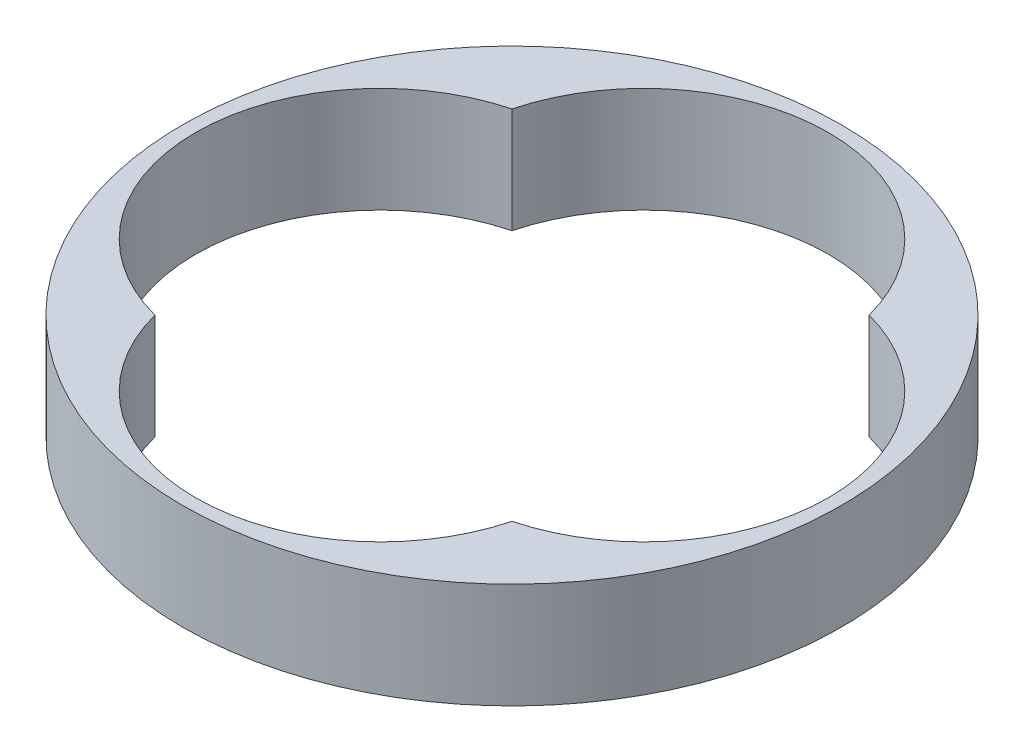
ISO-10303-21;
HEADER;
FILE_DESCRIPTION(('STEP AP214'),'2;1');
FILE_NAME('part.step','',(''),(''),'','','');
FILE_SCHEMA(('AUTOMOTIVE_DESIGN { 1 0 10303 214 1 1 1 1 }'));
ENDSEC;
DATA;
#1=APPLICATION_CONTEXT('core data for automotive mechanical design processes');
#2=APPLICATION_PROTOCOL_DEFINITION('international standard','automotive_design',2000,#1);
#3=PRODUCT_CONTEXT('',#1,'mechanical');
#4=PRODUCT('Part','Part','',(#3));
#5=PRODUCT_RELATED_PRODUCT_CATEGORY('part','',(#4));
#6=PRODUCT_DEFINITION_FORMATION('','',#4);
#7=PRODUCT_DEFINITION_CONTEXT('part definition',#1,'design');
#8=PRODUCT_DEFINITION('design','',#6,#7);
#9=PRODUCT_DEFINITION_SHAPE('','',#8);
#10=(LENGTH_UNIT() NAMED_UNIT(*) SI_UNIT(.MILLI.,.METRE.));
#11=(NAMED_UNIT(*) PLANE_ANGLE_UNIT() SI_UNIT($,.RADIAN.));
#12=(NAMED_UNIT(*) SI_UNIT($,.STERADIAN.) SOLID_ANGLE_UNIT());
#13=UNCERTAINTY_MEASURE_WITH_UNIT(LENGTH_MEASURE(1.E-05),#10,'distance_accuracy_value','');
#14=(GEOMETRIC_REPRESENTATION_CONTEXT(3) GLOBAL_UNCERTAINTY_ASSIGNED_CONTEXT((#13)) GLOBAL_UNIT_ASSIGNED_CONTEXT((#10,
#11,#12)) REPRESENTATION_CONTEXT('',''));
#15=CARTESIAN_POINT('',(0.,0.,0.));
#16=DIRECTION('',(0.,0.,1.));
#17=DIRECTION('',(1.,0.,0.));
#18=AXIS2_PLACEMENT_3D('',#15,#16,#17);
#19=CARTESIAN_POINT('',(0.,20.,0.));
#20=DIRECTION('',(0.,-1.,0.));
#21=DIRECTION('',(0.,0.,-1.));
#22=AXIS2_PLACEMENT_3D('',#19,#20,#21);
#23=CYLINDRICAL_SURFACE('',#22,62.5);
#24=CARTESIAN_POINT('',(0.,20.,0.));
#25=DIRECTION('',(0.,1.,0.));
#26=DIRECTION('',(0.,0.,1.));
#27=AXIS2_PLACEMENT_3D('',#24,#25,#26);
#28=CIRCLE('',#27,62.5);
#29=CARTESIAN_POINT('',(0.,20.,62.5));
#30=VERTEX_POINT('',#29);
#31=EDGE_CURVE('E12',#30,#30,#28,.T.);
#32=ORIENTED_EDGE('',*,*,#31,.F.);
#33=EDGE_LOOP('',(#32));
#34=FACE_BOUND('',#33,.T.);
#35=CARTESIAN_POINT('',(0.,0.,0.));
#36=DIRECTION('',(0.,1.,0.));
#37=DIRECTION('',(0.,0.,1.));
#38=AXIS2_PLACEMENT_3D('',#35,#36,#37);
#39=CIRCLE('',#38,62.5);
#40=CARTESIAN_POINT('',(0.,0.,62.5));
#41=VERTEX_POINT('',#40);
#42=EDGE_CURVE('E78',#41,#41,#39,.T.);
#43=ORIENTED_EDGE('',*,*,#42,.T.);
#44=EDGE_LOOP('',(#43));
#45=FACE_BOUND('',#44,.T.);
#46=ADVANCED_FACE('F75',(#34,#45),#23,.T.);
#47=CARTESIAN_POINT('',(0.,20.,0.));
#48=DIRECTION('',(0.,1.,0.));
#49=DIRECTION('',(0.,0.,1.));
#50=AXIS2_PLACEMENT_3D('',#47,#48,#49);
#51=PLANE('',#50);
#52=CARTESIAN_POINT('',(25.0000000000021,20.,-2.11478931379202E-12));
#53=DIRECTION('',(0.,1.,0.));
#54=DIRECTION('',(0.,0.,1.));
#55=AXIS2_PLACEMENT_3D('',#52,#53,#54);
#56=CIRCLE('',#55,35.0000000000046);
#57=CARTESIAN_POINT('',(33.8600093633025,20.,33.8600093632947));
#58=VERTEX_POINT('',#57);
#59=CARTESIAN_POINT('',(33.8600093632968,20.,-33.8600093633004));
#60=VERTEX_POINT('',#59);
#61=EDGE_CURVE('E128',#58,#60,#56,.T.);
#62=ORIENTED_EDGE('',*,*,#61,.F.);
#63=CARTESIAN_POINT('',(4.22957862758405E-12,20.,25.));
#64=DIRECTION('',(0.,1.,0.));
#65=DIRECTION('',(0.,0.,1.));
#66=AXIS2_PLACEMENT_3D('',#63,#64,#65);
#67=CIRCLE('',#66,35.0000000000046);
#68=CARTESIAN_POINT('',(-33.8600093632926,20.,33.8600093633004));
#69=VERTEX_POINT('',#68);
#70=EDGE_CURVE('E156',#69,#58,#67,.T.);
#71=ORIENTED_EDGE('',*,*,#70,.F.);
#72=CARTESIAN_POINT('',(-24.9999999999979,20.,2.11785093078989E-12));
#73=DIRECTION('',(0.,1.,0.));
#74=DIRECTION('',(0.,0.,1.));
#75=AXIS2_PLACEMENT_3D('',#72,#73,#74);
#76=CIRCLE('',#75,35.0000000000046);
#77=CARTESIAN_POINT('',(-33.8600093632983,20.,-33.8600093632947));
#78=VERTEX_POINT('',#77);
#79=EDGE_CURVE('E139',#78,#69,#76,.T.);
#80=ORIENTED_EDGE('',*,*,#79,.F.);
#81=CARTESIAN_POINT('',(0.,20.,-25.));
#82=DIRECTION('',(0.,1.,0.));
#83=DIRECTION('',(0.,0.,1.));
#84=AXIS2_PLACEMENT_3D('',#81,#82,#83);
#85=CIRCLE('',#84,35.0000000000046);
#86=EDGE_CURVE('E90',#60,#78,#85,.T.);
#87=ORIENTED_EDGE('',*,*,#86,.F.);
#88=EDGE_LOOP('',(#62,#71,#80,#87));
#89=FACE_BOUND('',#88,.T.);
#90=ORIENTED_EDGE('',*,*,#31,.T.);
#91=EDGE_LOOP('',(#90));
#92=FACE_BOUND('',#91,.T.);
#93=ADVANCED_FACE('F137',(#89,#92),#51,.T.);
#94=CARTESIAN_POINT('',(0.,0.,0.));
#95=DIRECTION('',(0.,1.,0.));
#96=DIRECTION('',(0.,0.,1.));
#97=AXIS2_PLACEMENT_3D('',#94,#95,#96);
#98=PLANE('',#97);
#99=CARTESIAN_POINT('',(4.22957862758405E-12,0.,25.));
#100=DIRECTION('',(0.,1.,0.));
#101=DIRECTION('',(0.,0.,1.));
#102=AXIS2_PLACEMENT_3D('',#99,#100,#101);
#103=CIRCLE('',#102,35.0000000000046);
#104=CARTESIAN_POINT('',(-33.8600093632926,0.,33.8600093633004));
#105=VERTEX_POINT('',#104);
#106=CARTESIAN_POINT('',(33.8600093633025,0.,33.8600093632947));
#107=VERTEX_POINT('',#106);
#108=EDGE_CURVE('E98',#105,#107,#103,.T.);
#109=ORIENTED_EDGE('',*,*,#108,.T.);
#110=CARTESIAN_POINT('',(25.0000000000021,0.,-2.11478931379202E-12));
#111=DIRECTION('',(0.,1.,0.));
#112=DIRECTION('',(0.,0.,1.));
#113=AXIS2_PLACEMENT_3D('',#110,#111,#112);
#114=CIRCLE('',#113,35.0000000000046);
#115=CARTESIAN_POINT('',(33.8600093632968,0.,-33.8600093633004));
#116=VERTEX_POINT('',#115);
#117=EDGE_CURVE('E134',#107,#116,#114,.T.);
#118=ORIENTED_EDGE('',*,*,#117,.T.);
#119=CARTESIAN_POINT('',(0.,0.,-25.));
#120=DIRECTION('',(0.,1.,0.));
#121=DIRECTION('',(0.,0.,1.));
#122=AXIS2_PLACEMENT_3D('',#119,#120,#121);
#123=CIRCLE('',#122,35.0000000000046);
#124=CARTESIAN_POINT('',(-33.8600093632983,0.,-33.8600093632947));
#125=VERTEX_POINT('',#124);
#126=EDGE_CURVE('E119',#116,#125,#123,.T.);
#127=ORIENTED_EDGE('',*,*,#126,.T.);
#128=CARTESIAN_POINT('',(-24.9999999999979,0.,2.11785093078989E-12));
#129=DIRECTION('',(0.,1.,0.));
#130=DIRECTION('',(0.,0.,1.));
#131=AXIS2_PLACEMENT_3D('',#128,#129,#130);
#132=CIRCLE('',#131,35.0000000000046);
#133=EDGE_CURVE('E146',#125,#105,#132,.T.);
#134=ORIENTED_EDGE('',*,*,#133,.T.);
#135=EDGE_LOOP('',(#109,#118,#127,#134));
#136=FACE_BOUND('',#135,.T.);
#137=ORIENTED_EDGE('',*,*,#42,.F.);
#138=EDGE_LOOP('',(#137));
#139=FACE_BOUND('',#138,.T.);
#140=ADVANCED_FACE('F170',(#136,#139),#98,.F.);
#141=CARTESIAN_POINT('',(0.,0.,-25.));
#142=DIRECTION('',(0.,1.,0.));
#143=DIRECTION('',(0.,0.,1.));
#144=AXIS2_PLACEMENT_3D('',#141,#142,#143);
#145=CYLINDRICAL_SURFACE('',#144,35.0000000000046);
#146=DIRECTION('',(0.,1.,0.));
#147=VECTOR('',#146,1.);
#148=CARTESIAN_POINT('',(-33.8600093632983,10.,-33.8600093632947));
#149=LINE('',#148,#147);
#150=EDGE_CURVE('E124',#78,#125,#149,.F.);
#151=ORIENTED_EDGE('',*,*,#150,.T.);
#152=ORIENTED_EDGE('',*,*,#126,.F.);
#153=DIRECTION('',(0.,1.,0.));
#154=VECTOR('',#153,1.);
#155=CARTESIAN_POINT('',(33.8600093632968,10.,-33.8600093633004));
#156=LINE('',#155,#154);
#157=EDGE_CURVE('E115',#116,#60,#156,.T.);
#158=ORIENTED_EDGE('',*,*,#157,.T.);
#159=ORIENTED_EDGE('',*,*,#86,.T.);
#160=EDGE_LOOP('',(#151,#152,#158,#159));
#161=FACE_BOUND('',#160,.T.);
#162=ADVANCED_FACE('F117',(#161),#145,.F.);
#163=CARTESIAN_POINT('',(4.22957862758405E-12,0.,25.));
#164=DIRECTION('',(0.,1.,0.));
#165=DIRECTION('',(0.,0.,1.));
#166=AXIS2_PLACEMENT_3D('',#163,#164,#165);
#167=CYLINDRICAL_SURFACE('',#166,35.0000000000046);
#168=ORIENTED_EDGE('',*,*,#70,.T.);
#169=DIRECTION('',(0.,1.,0.));
#170=VECTOR('',#169,1.);
#171=CARTESIAN_POINT('',(33.8600093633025,10.,33.8600093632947));
#172=LINE('',#171,#170);
#173=EDGE_CURVE('E130',#58,#107,#172,.F.);
#174=ORIENTED_EDGE('',*,*,#173,.T.);
#175=ORIENTED_EDGE('',*,*,#108,.F.);
#176=DIRECTION('',(0.,1.,0.));
#177=VECTOR('',#176,1.);
#178=CARTESIAN_POINT('',(-33.8600093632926,10.,33.8600093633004));
#179=LINE('',#178,#177);
#180=EDGE_CURVE('E141',#69,#105,#179,.F.);
#181=ORIENTED_EDGE('',*,*,#180,.F.);
#182=EDGE_LOOP('',(#168,#174,#175,#181));
#183=FACE_BOUND('',#182,.T.);
#184=ADVANCED_FACE('F177',(#183),#167,.F.);
#185=CARTESIAN_POINT('',(25.0000000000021,0.,-2.11478931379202E-12));
#186=DIRECTION('',(0.,1.,0.));
#187=DIRECTION('',(0.,0.,1.));
#188=AXIS2_PLACEMENT_3D('',#185,#186,#187);
#189=CYLINDRICAL_SURFACE('',#188,35.0000000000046);
#190=ORIENTED_EDGE('',*,*,#117,.F.);
#191=ORIENTED_EDGE('',*,*,#173,.F.);
#192=ORIENTED_EDGE('',*,*,#61,.T.);
#193=ORIENTED_EDGE('',*,*,#157,.F.);
#194=EDGE_LOOP('',(#190,#191,#192,#193));
#195=FACE_BOUND('',#194,.T.);
#196=ADVANCED_FACE('F129',(#195),#189,.F.);
#197=CARTESIAN_POINT('',(-24.9999999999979,0.,2.11785093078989E-12));
#198=DIRECTION('',(0.,1.,0.));
#199=DIRECTION('',(0.,0.,1.));
#200=AXIS2_PLACEMENT_3D('',#197,#198,#199);
#201=CYLINDRICAL_SURFACE('',#200,35.0000000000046);
#202=ORIENTED_EDGE('',*,*,#79,.T.);
#203=ORIENTED_EDGE('',*,*,#180,.T.);
#204=ORIENTED_EDGE('',*,*,#133,.F.);
#205=ORIENTED_EDGE('',*,*,#150,.F.);
#206=EDGE_LOOP('',(#202,#203,#204,#205));
#207=FACE_BOUND('',#206,.T.);
#208=ADVANCED_FACE('F216',(#207),#201,.F.);
#209=CLOSED_SHELL('',(#46,#93,#140,#162,#184,#196,#208));
#210=MANIFOLD_SOLID_BREP('B2',#209);
#211=ADVANCED_BREP_SHAPE_REPRESENTATION('',(#18,#210),#14);
#212=SHAPE_DEFINITION_REPRESENTATION(#9,#211);
ENDSEC;
END-ISO-10303-21;
